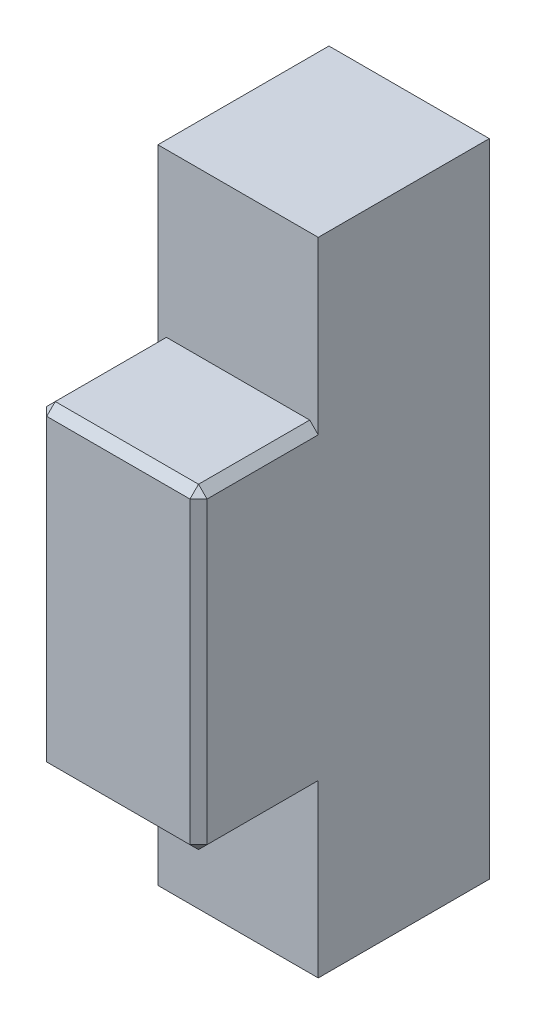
ISO-10303-21;
HEADER;
FILE_DESCRIPTION(('STEP AP214'),'2;1');
FILE_NAME('part.step','',(''),(''),'','','');
FILE_SCHEMA(('AUTOMOTIVE_DESIGN { 1 0 10303 214 1 1 1 1 }'));
ENDSEC;
DATA;
#1=APPLICATION_CONTEXT('core data for automotive mechanical design processes');
#2=APPLICATION_PROTOCOL_DEFINITION('international standard','automotive_design',2000,#1);
#3=PRODUCT_CONTEXT('',#1,'mechanical');
#4=PRODUCT('Part','Part','',(#3));
#5=PRODUCT_RELATED_PRODUCT_CATEGORY('part','',(#4));
#6=PRODUCT_DEFINITION_FORMATION('','',#4);
#7=PRODUCT_DEFINITION_CONTEXT('part definition',#1,'design');
#8=PRODUCT_DEFINITION('design','',#6,#7);
#9=PRODUCT_DEFINITION_SHAPE('','',#8);
#10=(LENGTH_UNIT() NAMED_UNIT(*) SI_UNIT(.MILLI.,.METRE.));
#11=(NAMED_UNIT(*) PLANE_ANGLE_UNIT() SI_UNIT($,.RADIAN.));
#12=(NAMED_UNIT(*) SI_UNIT($,.STERADIAN.) SOLID_ANGLE_UNIT());
#13=UNCERTAINTY_MEASURE_WITH_UNIT(LENGTH_MEASURE(1.E-05),#10,'distance_accuracy_value','');
#14=(GEOMETRIC_REPRESENTATION_CONTEXT(3) GLOBAL_UNCERTAINTY_ASSIGNED_CONTEXT((#13)) GLOBAL_UNIT_ASSIGNED_CONTEXT((#10,
#11,#12)) REPRESENTATION_CONTEXT('',''));
#15=CARTESIAN_POINT('',(0.,0.,0.));
#16=DIRECTION('',(0.,0.,1.));
#17=DIRECTION('',(1.,0.,0.));
#18=AXIS2_PLACEMENT_3D('',#15,#16,#17);
#19=CARTESIAN_POINT('',(641.29476620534,19.05,10.16));
#20=DIRECTION('',(0.,0.,1.));
#21=DIRECTION('',(1.,0.,0.));
#22=AXIS2_PLACEMENT_3D('',#19,#20,#21);
#23=PLANE('',#22);
#24=DIRECTION('',(1.,0.,0.));
#25=VECTOR('',#24,1.);
#26=CARTESIAN_POINT('',(641.29476620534,-9.398,10.16));
#27=LINE('',#26,#25);
#28=CARTESIAN_POINT('',(641.80276620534,-9.398,10.16));
#29=VERTEX_POINT('',#28);
#30=CARTESIAN_POINT('',(650.311766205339,-9.398,10.16));
#31=VERTEX_POINT('',#30);
#32=EDGE_CURVE('E156',#29,#31,#27,.T.);
#33=ORIENTED_EDGE('',*,*,#32,.F.);
#34=DIRECTION('',(0.707106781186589,-0.707106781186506,0.));
#35=VECTOR('',#34,1.);
#36=CARTESIAN_POINT('',(641.80276620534,-9.398,10.16));
#37=LINE('',#36,#35);
#38=CARTESIAN_POINT('',(641.29476620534,-8.89,10.16));
#39=VERTEX_POINT('',#38);
#40=EDGE_CURVE('E11',#29,#39,#37,.F.);
#41=ORIENTED_EDGE('',*,*,#40,.T.);
#42=DIRECTION('',(0.,-1.,0.));
#43=VECTOR('',#42,1.);
#44=CARTESIAN_POINT('',(641.29476620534,19.05,10.16));
#45=LINE('',#44,#43);
#46=CARTESIAN_POINT('',(641.29476620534,-19.05,10.16));
#47=VERTEX_POINT('',#46);
#48=EDGE_CURVE('E170',#39,#47,#45,.T.);
#49=ORIENTED_EDGE('',*,*,#48,.T.);
#50=DIRECTION('',(1.,0.,0.));
#51=VECTOR('',#50,1.);
#52=CARTESIAN_POINT('',(641.29476620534,-19.05,10.16));
#53=LINE('',#52,#51);
#54=CARTESIAN_POINT('',(650.81976620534,-19.05,10.16));
#55=VERTEX_POINT('',#54);
#56=EDGE_CURVE('E173',#47,#55,#53,.T.);
#57=ORIENTED_EDGE('',*,*,#56,.T.);
#58=DIRECTION('',(0.,1.,0.));
#59=VECTOR('',#58,1.);
#60=CARTESIAN_POINT('',(650.81976620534,-19.05,10.16));
#61=LINE('',#60,#59);
#62=CARTESIAN_POINT('',(650.81976620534,-8.89,10.16));
#63=VERTEX_POINT('',#62);
#64=EDGE_CURVE('E184',#55,#63,#61,.T.);
#65=ORIENTED_EDGE('',*,*,#64,.T.);
#66=DIRECTION('',(0.70710678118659,0.707106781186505,0.));
#67=VECTOR('',#66,1.);
#68=CARTESIAN_POINT('',(650.81976620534,-8.89,10.16));
#69=LINE('',#68,#67);
#70=EDGE_CURVE('E40',#63,#31,#69,.F.);
#71=ORIENTED_EDGE('',*,*,#70,.T.);
#72=EDGE_LOOP('',(#33,#41,#49,#57,#65,#71));
#73=FACE_BOUND('',#72,.T.);
#74=ADVANCED_FACE('F32',(#73),#23,.T.);
#75=CARTESIAN_POINT('',(650.81976620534,19.05,10.16));
#76=DIRECTION('',(0.,-1.,0.));
#77=DIRECTION('',(0.,0.,-1.));
#78=AXIS2_PLACEMENT_3D('',#75,#76,#77);
#79=PLANE('',#78);
#80=DIRECTION('',(-1.,0.,0.));
#81=VECTOR('',#80,1.);
#82=CARTESIAN_POINT('',(650.81976620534,19.05,0.));
#83=LINE('',#82,#81);
#84=CARTESIAN_POINT('',(650.81976620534,19.05,0.));
#85=VERTEX_POINT('',#84);
#86=CARTESIAN_POINT('',(641.29476620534,19.05,0.));
#87=VERTEX_POINT('',#86);
#88=EDGE_CURVE('E137',#85,#87,#83,.T.);
#89=ORIENTED_EDGE('',*,*,#88,.T.);
#90=DIRECTION('',(0.,0.,-1.));
#91=VECTOR('',#90,1.);
#92=CARTESIAN_POINT('',(641.29476620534,19.05,10.16));
#93=LINE('',#92,#91);
#94=CARTESIAN_POINT('',(641.29476620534,19.05,10.16));
#95=VERTEX_POINT('',#94);
#96=EDGE_CURVE('E144',#95,#87,#93,.T.);
#97=ORIENTED_EDGE('',*,*,#96,.F.);
#98=DIRECTION('',(-1.,0.,0.));
#99=VECTOR('',#98,1.);
#100=CARTESIAN_POINT('',(650.81976620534,19.05,10.16));
#101=LINE('',#100,#99);
#102=CARTESIAN_POINT('',(650.81976620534,19.05,10.16));
#103=VERTEX_POINT('',#102);
#104=EDGE_CURVE('E168',#103,#95,#101,.T.);
#105=ORIENTED_EDGE('',*,*,#104,.F.);
#106=DIRECTION('',(0.,0.,-1.));
#107=VECTOR('',#106,1.);
#108=CARTESIAN_POINT('',(650.81976620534,19.05,10.16));
#109=LINE('',#108,#107);
#110=EDGE_CURVE('E155',#103,#85,#109,.T.);
#111=ORIENTED_EDGE('',*,*,#110,.T.);
#112=EDGE_LOOP('',(#89,#97,#105,#111));
#113=FACE_BOUND('',#112,.T.);
#114=ADVANCED_FACE('F34',(#113),#79,.F.);
#115=CARTESIAN_POINT('',(641.29476620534,19.05,10.16));
#116=DIRECTION('',(1.,0.,0.));
#117=DIRECTION('',(0.,0.,-1.));
#118=AXIS2_PLACEMENT_3D('',#115,#116,#117);
#119=PLANE('',#118);
#120=DIRECTION('',(0.,0.,-1.));
#121=VECTOR('',#120,1.);
#122=CARTESIAN_POINT('',(641.29476620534,8.89,10.16));
#123=LINE('',#122,#121);
#124=CARTESIAN_POINT('',(641.29476620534,8.89,16.764));
#125=VERTEX_POINT('',#124);
#126=CARTESIAN_POINT('',(641.29476620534,8.89,10.16));
#127=VERTEX_POINT('',#126);
#128=EDGE_CURVE('E224',#125,#127,#123,.T.);
#129=ORIENTED_EDGE('',*,*,#128,.T.);
#130=EDGE_CURVE('E147',#95,#127,#45,.T.);
#131=ORIENTED_EDGE('',*,*,#130,.F.);
#132=ORIENTED_EDGE('',*,*,#96,.T.);
#133=DIRECTION('',(0.,-1.,0.));
#134=VECTOR('',#133,1.);
#135=CARTESIAN_POINT('',(641.29476620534,19.05,0.));
#136=LINE('',#135,#134);
#137=CARTESIAN_POINT('',(641.29476620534,-19.05,0.));
#138=VERTEX_POINT('',#137);
#139=EDGE_CURVE('E132',#87,#138,#136,.T.);
#140=ORIENTED_EDGE('',*,*,#139,.T.);
#141=DIRECTION('',(0.,0.,-1.));
#142=VECTOR('',#141,1.);
#143=CARTESIAN_POINT('',(641.29476620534,-19.05,10.16));
#144=LINE('',#143,#142);
#145=EDGE_CURVE('E152',#47,#138,#144,.T.);
#146=ORIENTED_EDGE('',*,*,#145,.F.);
#147=ORIENTED_EDGE('',*,*,#48,.F.);
#148=DIRECTION('',(0.,0.,1.));
#149=VECTOR('',#148,1.);
#150=CARTESIAN_POINT('',(641.29476620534,-8.89,10.16));
#151=LINE('',#150,#149);
#152=CARTESIAN_POINT('',(641.29476620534,-8.89,16.764));
#153=VERTEX_POINT('',#152);
#154=EDGE_CURVE('E293',#39,#153,#151,.T.);
#155=ORIENTED_EDGE('',*,*,#154,.T.);
#156=DIRECTION('',(0.,1.,0.));
#157=VECTOR('',#156,1.);
#158=CARTESIAN_POINT('',(641.29476620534,9.398,16.764));
#159=LINE('',#158,#157);
#160=EDGE_CURVE('E294',#153,#125,#159,.T.);
#161=ORIENTED_EDGE('',*,*,#160,.T.);
#162=EDGE_LOOP('',(#129,#131,#132,#140,#146,#147,#155,#161));
#163=FACE_BOUND('',#162,.T.);
#164=ADVANCED_FACE('F146',(#163),#119,.F.);
#165=CARTESIAN_POINT('',(641.29476620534,-19.05,10.16));
#166=DIRECTION('',(0.,1.,0.));
#167=DIRECTION('',(0.,0.,1.));
#168=AXIS2_PLACEMENT_3D('',#165,#166,#167);
#169=PLANE('',#168);
#170=DIRECTION('',(1.,0.,0.));
#171=VECTOR('',#170,1.);
#172=CARTESIAN_POINT('',(641.29476620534,-19.05,0.));
#173=LINE('',#172,#171);
#174=CARTESIAN_POINT('',(650.81976620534,-19.05,0.));
#175=VERTEX_POINT('',#174);
#176=EDGE_CURVE('E138',#138,#175,#173,.T.);
#177=ORIENTED_EDGE('',*,*,#176,.T.);
#178=DIRECTION('',(0.,0.,-1.));
#179=VECTOR('',#178,1.);
#180=CARTESIAN_POINT('',(650.81976620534,-19.05,10.16));
#181=LINE('',#180,#179);
#182=EDGE_CURVE('E181',#55,#175,#181,.T.);
#183=ORIENTED_EDGE('',*,*,#182,.F.);
#184=ORIENTED_EDGE('',*,*,#56,.F.);
#185=ORIENTED_EDGE('',*,*,#145,.T.);
#186=EDGE_LOOP('',(#177,#183,#184,#185));
#187=FACE_BOUND('',#186,.T.);
#188=ADVANCED_FACE('F197',(#187),#169,.F.);
#189=CARTESIAN_POINT('',(650.81976620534,-19.05,10.16));
#190=DIRECTION('',(-1.,0.,0.));
#191=DIRECTION('',(0.,0.,1.));
#192=AXIS2_PLACEMENT_3D('',#189,#190,#191);
#193=PLANE('',#192);
#194=CARTESIAN_POINT('',(650.81976620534,8.89,10.16));
#195=VERTEX_POINT('',#194);
#196=EDGE_CURVE('E47',#195,#103,#61,.T.);
#197=ORIENTED_EDGE('',*,*,#196,.F.);
#198=DIRECTION('',(0.,0.,1.));
#199=VECTOR('',#198,1.);
#200=CARTESIAN_POINT('',(650.81976620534,8.89,10.16));
#201=LINE('',#200,#199);
#202=CARTESIAN_POINT('',(650.81976620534,8.89,16.764));
#203=VERTEX_POINT('',#202);
#204=EDGE_CURVE('E52',#195,#203,#201,.T.);
#205=ORIENTED_EDGE('',*,*,#204,.T.);
#206=DIRECTION('',(0.,-1.,0.));
#207=VECTOR('',#206,1.);
#208=CARTESIAN_POINT('',(650.81976620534,-9.398,16.764));
#209=LINE('',#208,#207);
#210=CARTESIAN_POINT('',(650.81976620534,-8.89,16.764));
#211=VERTEX_POINT('',#210);
#212=EDGE_CURVE('E203',#203,#211,#209,.T.);
#213=ORIENTED_EDGE('',*,*,#212,.T.);
#214=DIRECTION('',(0.,0.,-1.));
#215=VECTOR('',#214,1.);
#216=CARTESIAN_POINT('',(650.81976620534,-8.89,10.16));
#217=LINE('',#216,#215);
#218=EDGE_CURVE('E200',#211,#63,#217,.T.);
#219=ORIENTED_EDGE('',*,*,#218,.T.);
#220=ORIENTED_EDGE('',*,*,#64,.F.);
#221=ORIENTED_EDGE('',*,*,#182,.T.);
#222=DIRECTION('',(0.,1.,0.));
#223=VECTOR('',#222,1.);
#224=CARTESIAN_POINT('',(650.81976620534,-19.05,0.));
#225=LINE('',#224,#223);
#226=EDGE_CURVE('E166',#175,#85,#225,.T.);
#227=ORIENTED_EDGE('',*,*,#226,.T.);
#228=ORIENTED_EDGE('',*,*,#110,.F.);
#229=EDGE_LOOP('',(#197,#205,#213,#219,#220,#221,#227,#228));
#230=FACE_BOUND('',#229,.T.);
#231=ADVANCED_FACE('F198',(#230),#193,.F.);
#232=DIRECTION('',(-1.,0.,0.));
#233=VECTOR('',#232,1.);
#234=CARTESIAN_POINT('',(650.81976620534,9.398,10.16));
#235=LINE('',#234,#233);
#236=CARTESIAN_POINT('',(650.311766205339,9.398,10.16));
#237=VERTEX_POINT('',#236);
#238=CARTESIAN_POINT('',(641.80276620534,9.398,10.16));
#239=VERTEX_POINT('',#238);
#240=EDGE_CURVE('E159',#237,#239,#235,.T.);
#241=ORIENTED_EDGE('',*,*,#240,.F.);
#242=DIRECTION('',(-0.707106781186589,0.707106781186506,0.));
#243=VECTOR('',#242,1.);
#244=CARTESIAN_POINT('',(650.311766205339,9.398,10.16));
#245=LINE('',#244,#243);
#246=EDGE_CURVE('E212',#237,#195,#245,.F.);
#247=ORIENTED_EDGE('',*,*,#246,.T.);
#248=ORIENTED_EDGE('',*,*,#196,.T.);
#249=ORIENTED_EDGE('',*,*,#104,.T.);
#250=ORIENTED_EDGE('',*,*,#130,.T.);
#251=DIRECTION('',(-0.70710678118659,-0.707106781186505,0.));
#252=VECTOR('',#251,1.);
#253=CARTESIAN_POINT('',(641.29476620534,8.89,10.16));
#254=LINE('',#253,#252);
#255=EDGE_CURVE('E213',#127,#239,#254,.F.);
#256=ORIENTED_EDGE('',*,*,#255,.T.);
#257=EDGE_LOOP('',(#241,#247,#248,#249,#250,#256));
#258=FACE_BOUND('',#257,.T.);
#259=ADVANCED_FACE('F303',(#258),#23,.T.);
#260=CARTESIAN_POINT('',(641.29476620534,19.05,0.));
#261=DIRECTION('',(0.,0.,1.));
#262=DIRECTION('',(1.,0.,0.));
#263=AXIS2_PLACEMENT_3D('',#260,#261,#262);
#264=PLANE('',#263);
#265=ORIENTED_EDGE('',*,*,#88,.F.);
#266=ORIENTED_EDGE('',*,*,#226,.F.);
#267=ORIENTED_EDGE('',*,*,#176,.F.);
#268=ORIENTED_EDGE('',*,*,#139,.F.);
#269=EDGE_LOOP('',(#265,#266,#267,#268));
#270=FACE_BOUND('',#269,.T.);
#271=ADVANCED_FACE('F134',(#270),#264,.F.);
#272=CARTESIAN_POINT('',(650.81976620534,9.398,17.272));
#273=DIRECTION('',(0.,-1.,0.));
#274=DIRECTION('',(0.,0.,-1.));
#275=AXIS2_PLACEMENT_3D('',#272,#273,#274);
#276=PLANE('',#275);
#277=ORIENTED_EDGE('',*,*,#240,.T.);
#278=DIRECTION('',(0.,0.,1.));
#279=VECTOR('',#278,1.);
#280=CARTESIAN_POINT('',(641.80276620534,9.398,17.272));
#281=LINE('',#280,#279);
#282=CARTESIAN_POINT('',(641.80276620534,9.398,16.764));
#283=VERTEX_POINT('',#282);
#284=EDGE_CURVE('E207',#239,#283,#281,.T.);
#285=ORIENTED_EDGE('',*,*,#284,.T.);
#286=DIRECTION('',(1.,0.,0.));
#287=VECTOR('',#286,1.);
#288=CARTESIAN_POINT('',(650.81976620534,9.398,16.764));
#289=LINE('',#288,#287);
#290=CARTESIAN_POINT('',(650.311766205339,9.398,16.764));
#291=VERTEX_POINT('',#290);
#292=EDGE_CURVE('E220',#283,#291,#289,.T.);
#293=ORIENTED_EDGE('',*,*,#292,.T.);
#294=DIRECTION('',(0.,0.,-1.));
#295=VECTOR('',#294,1.);
#296=CARTESIAN_POINT('',(650.311766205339,9.398,17.272));
#297=LINE('',#296,#295);
#298=EDGE_CURVE('E222',#291,#237,#297,.T.);
#299=ORIENTED_EDGE('',*,*,#298,.T.);
#300=EDGE_LOOP('',(#277,#285,#293,#299));
#301=FACE_BOUND('',#300,.T.);
#302=ADVANCED_FACE('F306',(#301),#276,.F.);
#303=CARTESIAN_POINT('',(641.29476620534,-9.398,17.272));
#304=DIRECTION('',(0.,1.,0.));
#305=DIRECTION('',(0.,0.,1.));
#306=AXIS2_PLACEMENT_3D('',#303,#304,#305);
#307=PLANE('',#306);
#308=ORIENTED_EDGE('',*,*,#32,.T.);
#309=DIRECTION('',(0.,0.,1.));
#310=VECTOR('',#309,1.);
#311=CARTESIAN_POINT('',(650.311766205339,-9.398,17.272));
#312=LINE('',#311,#310);
#313=CARTESIAN_POINT('',(650.311766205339,-9.398,16.764));
#314=VERTEX_POINT('',#313);
#315=EDGE_CURVE('E211',#31,#314,#312,.T.);
#316=ORIENTED_EDGE('',*,*,#315,.T.);
#317=DIRECTION('',(-1.,0.,0.));
#318=VECTOR('',#317,1.);
#319=CARTESIAN_POINT('',(641.29476620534,-9.398,16.764));
#320=LINE('',#319,#318);
#321=CARTESIAN_POINT('',(641.80276620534,-9.398,16.764));
#322=VERTEX_POINT('',#321);
#323=EDGE_CURVE('E271',#314,#322,#320,.T.);
#324=ORIENTED_EDGE('',*,*,#323,.T.);
#325=DIRECTION('',(0.,0.,-1.));
#326=VECTOR('',#325,1.);
#327=CARTESIAN_POINT('',(641.80276620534,-9.398,17.272));
#328=LINE('',#327,#326);
#329=EDGE_CURVE('E285',#322,#29,#328,.T.);
#330=ORIENTED_EDGE('',*,*,#329,.T.);
#331=EDGE_LOOP('',(#308,#316,#324,#330));
#332=FACE_BOUND('',#331,.T.);
#333=ADVANCED_FACE('F381',(#332),#307,.F.);
#334=CARTESIAN_POINT('',(650.81976620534,9.398,17.272));
#335=DIRECTION('',(0.,0.,1.));
#336=DIRECTION('',(1.,0.,0.));
#337=AXIS2_PLACEMENT_3D('',#334,#335,#336);
#338=PLANE('',#337);
#339=DIRECTION('',(0.,-1.,0.));
#340=VECTOR('',#339,1.);
#341=CARTESIAN_POINT('',(641.80276620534,-9.398,17.272));
#342=LINE('',#341,#340);
#343=CARTESIAN_POINT('',(641.80276620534,8.88999999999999,17.272));
#344=VERTEX_POINT('',#343);
#345=CARTESIAN_POINT('',(641.80276620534,-8.89,17.272));
#346=VERTEX_POINT('',#345);
#347=EDGE_CURVE('E283',#344,#346,#342,.T.);
#348=ORIENTED_EDGE('',*,*,#347,.T.);
#349=DIRECTION('',(1.,0.,0.));
#350=VECTOR('',#349,1.);
#351=CARTESIAN_POINT('',(650.81976620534,-8.89,17.272));
#352=LINE('',#351,#350);
#353=CARTESIAN_POINT('',(650.311766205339,-8.89,17.272));
#354=VERTEX_POINT('',#353);
#355=EDGE_CURVE('E269',#346,#354,#352,.T.);
#356=ORIENTED_EDGE('',*,*,#355,.T.);
#357=DIRECTION('',(0.,1.,0.));
#358=VECTOR('',#357,1.);
#359=CARTESIAN_POINT('',(650.311766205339,9.398,17.272));
#360=LINE('',#359,#358);
#361=CARTESIAN_POINT('',(650.311766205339,8.88999999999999,17.272));
#362=VERTEX_POINT('',#361);
#363=EDGE_CURVE('E151',#354,#362,#360,.T.);
#364=ORIENTED_EDGE('',*,*,#363,.T.);
#365=DIRECTION('',(-1.,0.,0.));
#366=VECTOR('',#365,1.);
#367=CARTESIAN_POINT('',(641.29476620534,8.88999999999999,17.272));
#368=LINE('',#367,#366);
#369=EDGE_CURVE('E280',#362,#344,#368,.T.);
#370=ORIENTED_EDGE('',*,*,#369,.T.);
#371=EDGE_LOOP('',(#348,#356,#364,#370));
#372=FACE_BOUND('',#371,.T.);
#373=ADVANCED_FACE('F281',(#372),#338,.T.);
#374=CARTESIAN_POINT('',(641.29476620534,8.89,10.16));
#375=DIRECTION('',(0.707106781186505,-0.70710678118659,0.));
#376=DIRECTION('',(0.70710678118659,0.707106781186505,0.));
#377=AXIS2_PLACEMENT_3D('',#374,#375,#376);
#378=PLANE('',#377);
#379=ORIENTED_EDGE('',*,*,#255,.F.);
#380=ORIENTED_EDGE('',*,*,#128,.F.);
#381=DIRECTION('',(0.70710678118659,0.707106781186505,0.));
#382=VECTOR('',#381,1.);
#383=CARTESIAN_POINT('',(641.29476620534,8.89,16.764));
#384=LINE('',#383,#382);
#385=EDGE_CURVE('E227',#283,#125,#384,.F.);
#386=ORIENTED_EDGE('',*,*,#385,.F.);
#387=ORIENTED_EDGE('',*,*,#284,.F.);
#388=EDGE_LOOP('',(#379,#380,#386,#387));
#389=FACE_BOUND('',#388,.T.);
#390=ADVANCED_FACE('F301',(#389),#378,.F.);
#391=CARTESIAN_POINT('',(650.81976620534,8.88999999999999,17.272));
#392=DIRECTION('',(0.,0.707106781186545,0.70710678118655));
#393=DIRECTION('',(0.,-0.70710678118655,0.707106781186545));
#394=AXIS2_PLACEMENT_3D('',#391,#392,#393);
#395=PLANE('',#394);
#396=DIRECTION('',(0.,-0.70710678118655,0.707106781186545));
#397=VECTOR('',#396,1.);
#398=CARTESIAN_POINT('',(650.311766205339,9.398,16.764));
#399=LINE('',#398,#397);
#400=EDGE_CURVE('E236',#291,#362,#399,.T.);
#401=ORIENTED_EDGE('',*,*,#400,.F.);
#402=ORIENTED_EDGE('',*,*,#292,.F.);
#403=DIRECTION('',(0.,0.70710678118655,-0.707106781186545));
#404=VECTOR('',#403,1.);
#405=CARTESIAN_POINT('',(641.80276620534,9.144,17.018));
#406=LINE('',#405,#404);
#407=EDGE_CURVE('E233',#344,#283,#406,.T.);
#408=ORIENTED_EDGE('',*,*,#407,.F.);
#409=ORIENTED_EDGE('',*,*,#369,.F.);
#410=EDGE_LOOP('',(#401,#402,#408,#409));
#411=FACE_BOUND('',#410,.T.);
#412=ADVANCED_FACE('F313',(#411),#395,.T.);
#413=CARTESIAN_POINT('',(650.311766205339,9.398,17.272));
#414=DIRECTION('',(-0.707106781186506,-0.707106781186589,0.));
#415=DIRECTION('',(0.707106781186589,-0.707106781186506,0.));
#416=AXIS2_PLACEMENT_3D('',#413,#414,#415);
#417=PLANE('',#416);
#418=ORIENTED_EDGE('',*,*,#246,.F.);
#419=ORIENTED_EDGE('',*,*,#298,.F.);
#420=DIRECTION('',(0.707106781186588,-0.707106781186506,0.));
#421=VECTOR('',#420,1.);
#422=CARTESIAN_POINT('',(650.311766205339,9.398,16.764));
#423=LINE('',#422,#421);
#424=EDGE_CURVE('E239',#203,#291,#423,.F.);
#425=ORIENTED_EDGE('',*,*,#424,.F.);
#426=ORIENTED_EDGE('',*,*,#204,.F.);
#427=EDGE_LOOP('',(#418,#419,#425,#426));
#428=FACE_BOUND('',#427,.T.);
#429=ADVANCED_FACE('F311',(#428),#417,.F.);
#430=CARTESIAN_POINT('',(641.29476620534,8.89,16.764));
#431=DIRECTION('',(-0.577350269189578,0.577350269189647,0.577350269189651));
#432=DIRECTION('',(0.,-0.70710678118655,0.707106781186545));
#433=AXIS2_PLACEMENT_3D('',#430,#431,#432);
#434=PLANE('',#433);
#435=ORIENTED_EDGE('',*,*,#407,.T.);
#436=ORIENTED_EDGE('',*,*,#385,.T.);
#437=DIRECTION('',(0.707106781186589,0.,0.707106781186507));
#438=VECTOR('',#437,1.);
#439=CARTESIAN_POINT('',(641.29476620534,8.89,16.764));
#440=LINE('',#439,#438);
#441=EDGE_CURVE('E242',#344,#125,#440,.F.);
#442=ORIENTED_EDGE('',*,*,#441,.F.);
#443=EDGE_LOOP('',(#435,#436,#442));
#444=FACE_BOUND('',#443,.T.);
#445=ADVANCED_FACE('F319',(#444),#434,.T.);
#446=CARTESIAN_POINT('',(650.311766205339,9.398,16.764));
#447=DIRECTION('',(0.57735026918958,0.577350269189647,0.577350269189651));
#448=DIRECTION('',(0.,-0.70710678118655,0.707106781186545));
#449=AXIS2_PLACEMENT_3D('',#446,#447,#448);
#450=PLANE('',#449);
#451=ORIENTED_EDGE('',*,*,#424,.T.);
#452=ORIENTED_EDGE('',*,*,#400,.T.);
#453=DIRECTION('',(0.707106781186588,0.,-0.707106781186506));
#454=VECTOR('',#453,1.);
#455=CARTESIAN_POINT('',(650.56576620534,8.88999999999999,17.018));
#456=LINE('',#455,#454);
#457=EDGE_CURVE('E245',#203,#362,#456,.F.);
#458=ORIENTED_EDGE('',*,*,#457,.F.);
#459=EDGE_LOOP('',(#451,#452,#458));
#460=FACE_BOUND('',#459,.T.);
#461=ADVANCED_FACE('F316',(#460),#450,.T.);
#462=CARTESIAN_POINT('',(641.80276620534,-9.398,17.272));
#463=DIRECTION('',(0.707106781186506,0.707106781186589,0.));
#464=DIRECTION('',(-0.707106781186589,0.707106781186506,0.));
#465=AXIS2_PLACEMENT_3D('',#462,#463,#464);
#466=PLANE('',#465);
#467=ORIENTED_EDGE('',*,*,#40,.F.);
#468=ORIENTED_EDGE('',*,*,#329,.F.);
#469=DIRECTION('',(-0.707106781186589,0.707106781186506,0.));
#470=VECTOR('',#469,1.);
#471=CARTESIAN_POINT('',(641.80276620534,-9.398,16.764));
#472=LINE('',#471,#470);
#473=EDGE_CURVE('E248',#153,#322,#472,.F.);
#474=ORIENTED_EDGE('',*,*,#473,.F.);
#475=ORIENTED_EDGE('',*,*,#154,.F.);
#476=EDGE_LOOP('',(#467,#468,#474,#475));
#477=FACE_BOUND('',#476,.T.);
#478=ADVANCED_FACE('F318',(#477),#466,.F.);
#479=CARTESIAN_POINT('',(641.80276620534,9.398,17.272));
#480=DIRECTION('',(-0.707106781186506,0.,0.707106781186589));
#481=DIRECTION('',(0.707106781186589,0.,0.707106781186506));
#482=AXIS2_PLACEMENT_3D('',#479,#480,#481);
#483=PLANE('',#482);
#484=ORIENTED_EDGE('',*,*,#441,.T.);
#485=ORIENTED_EDGE('',*,*,#160,.F.);
#486=DIRECTION('',(-0.707106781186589,0.,-0.707106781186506));
#487=VECTOR('',#486,1.);
#488=CARTESIAN_POINT('',(641.54876620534,-8.89,17.018));
#489=LINE('',#488,#487);
#490=EDGE_CURVE('E251',#346,#153,#489,.T.);
#491=ORIENTED_EDGE('',*,*,#490,.F.);
#492=ORIENTED_EDGE('',*,*,#347,.F.);
#493=EDGE_LOOP('',(#484,#485,#491,#492));
#494=FACE_BOUND('',#493,.T.);
#495=ADVANCED_FACE('F325',(#494),#483,.T.);
#496=CARTESIAN_POINT('',(650.311766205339,9.398,17.272));
#497=DIRECTION('',(0.707106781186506,0.,0.707106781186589));
#498=DIRECTION('',(0.707106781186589,0.,-0.707106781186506));
#499=AXIS2_PLACEMENT_3D('',#496,#497,#498);
#500=PLANE('',#499);
#501=ORIENTED_EDGE('',*,*,#457,.T.);
#502=ORIENTED_EDGE('',*,*,#363,.F.);
#503=DIRECTION('',(-0.707106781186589,0.,0.707106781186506));
#504=VECTOR('',#503,1.);
#505=CARTESIAN_POINT('',(650.311766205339,-8.89,17.272));
#506=LINE('',#505,#504);
#507=EDGE_CURVE('E254',#211,#354,#506,.T.);
#508=ORIENTED_EDGE('',*,*,#507,.F.);
#509=ORIENTED_EDGE('',*,*,#212,.F.);
#510=EDGE_LOOP('',(#501,#502,#508,#509));
#511=FACE_BOUND('',#510,.T.);
#512=ADVANCED_FACE('F276',(#511),#500,.T.);
#513=CARTESIAN_POINT('',(650.81976620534,-8.89,10.16));
#514=DIRECTION('',(-0.707106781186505,0.70710678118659,0.));
#515=DIRECTION('',(-0.70710678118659,-0.707106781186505,0.));
#516=AXIS2_PLACEMENT_3D('',#513,#514,#515);
#517=PLANE('',#516);
#518=ORIENTED_EDGE('',*,*,#70,.F.);
#519=ORIENTED_EDGE('',*,*,#218,.F.);
#520=DIRECTION('',(-0.70710678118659,-0.707106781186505,0.));
#521=VECTOR('',#520,1.);
#522=CARTESIAN_POINT('',(650.56576620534,-9.14400000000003,16.764));
#523=LINE('',#522,#521);
#524=EDGE_CURVE('E257',#314,#211,#523,.F.);
#525=ORIENTED_EDGE('',*,*,#524,.F.);
#526=ORIENTED_EDGE('',*,*,#315,.F.);
#527=EDGE_LOOP('',(#518,#519,#525,#526));
#528=FACE_BOUND('',#527,.T.);
#529=ADVANCED_FACE('F210',(#528),#517,.F.);
#530=CARTESIAN_POINT('',(641.80276620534,-9.398,16.764));
#531=DIRECTION('',(-0.577350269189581,-0.577350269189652,0.577350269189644));
#532=DIRECTION('',(0.,-0.707106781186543,-0.707106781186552));
#533=AXIS2_PLACEMENT_3D('',#530,#531,#532);
#534=PLANE('',#533);
#535=ORIENTED_EDGE('',*,*,#490,.T.);
#536=ORIENTED_EDGE('',*,*,#473,.T.);
#537=DIRECTION('',(0.,0.707106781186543,0.707106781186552));
#538=VECTOR('',#537,1.);
#539=CARTESIAN_POINT('',(641.80276620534,-9.398,16.764));
#540=LINE('',#539,#538);
#541=EDGE_CURVE('E260',#346,#322,#540,.F.);
#542=ORIENTED_EDGE('',*,*,#541,.F.);
#543=EDGE_LOOP('',(#535,#536,#542));
#544=FACE_BOUND('',#543,.T.);
#545=ADVANCED_FACE('F464',(#544),#534,.T.);
#546=CARTESIAN_POINT('',(650.311766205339,-8.89,17.272));
#547=DIRECTION('',(0.57735026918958,-0.577350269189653,0.577350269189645));
#548=DIRECTION('',(0.,-0.707106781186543,-0.707106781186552));
#549=AXIS2_PLACEMENT_3D('',#546,#547,#548);
#550=PLANE('',#549);
#551=ORIENTED_EDGE('',*,*,#524,.T.);
#552=ORIENTED_EDGE('',*,*,#507,.T.);
#553=DIRECTION('',(0.,-0.707106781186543,-0.707106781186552));
#554=VECTOR('',#553,1.);
#555=CARTESIAN_POINT('',(650.311766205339,-8.89,17.272));
#556=LINE('',#555,#554);
#557=EDGE_CURVE('E262',#314,#354,#556,.F.);
#558=ORIENTED_EDGE('',*,*,#557,.F.);
#559=EDGE_LOOP('',(#551,#552,#558));
#560=FACE_BOUND('',#559,.T.);
#561=ADVANCED_FACE('F274',(#560),#550,.T.);
#562=CARTESIAN_POINT('',(650.81976620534,-8.89,17.272));
#563=DIRECTION('',(0.,-0.707106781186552,0.707106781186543));
#564=DIRECTION('',(0.,-0.707106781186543,-0.707106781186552));
#565=AXIS2_PLACEMENT_3D('',#562,#563,#564);
#566=PLANE('',#565);
#567=ORIENTED_EDGE('',*,*,#541,.T.);
#568=ORIENTED_EDGE('',*,*,#323,.F.);
#569=ORIENTED_EDGE('',*,*,#557,.T.);
#570=ORIENTED_EDGE('',*,*,#355,.F.);
#571=EDGE_LOOP('',(#567,#568,#569,#570));
#572=FACE_BOUND('',#571,.T.);
#573=ADVANCED_FACE('F267',(#572),#566,.T.);
#574=CLOSED_SHELL('',(#74,#114,#164,#188,#231,#259,#271,#302,#333,#373,#390,#412,#429,#445,#461,
#478,#495,#512,#529,#545,#561,#573));
#575=MANIFOLD_SOLID_BREP('B2',#574);
#576=ADVANCED_BREP_SHAPE_REPRESENTATION('',(#18,#575),#14);
#577=SHAPE_DEFINITION_REPRESENTATION(#9,#576);
ENDSEC;
END-ISO-10303-21;
